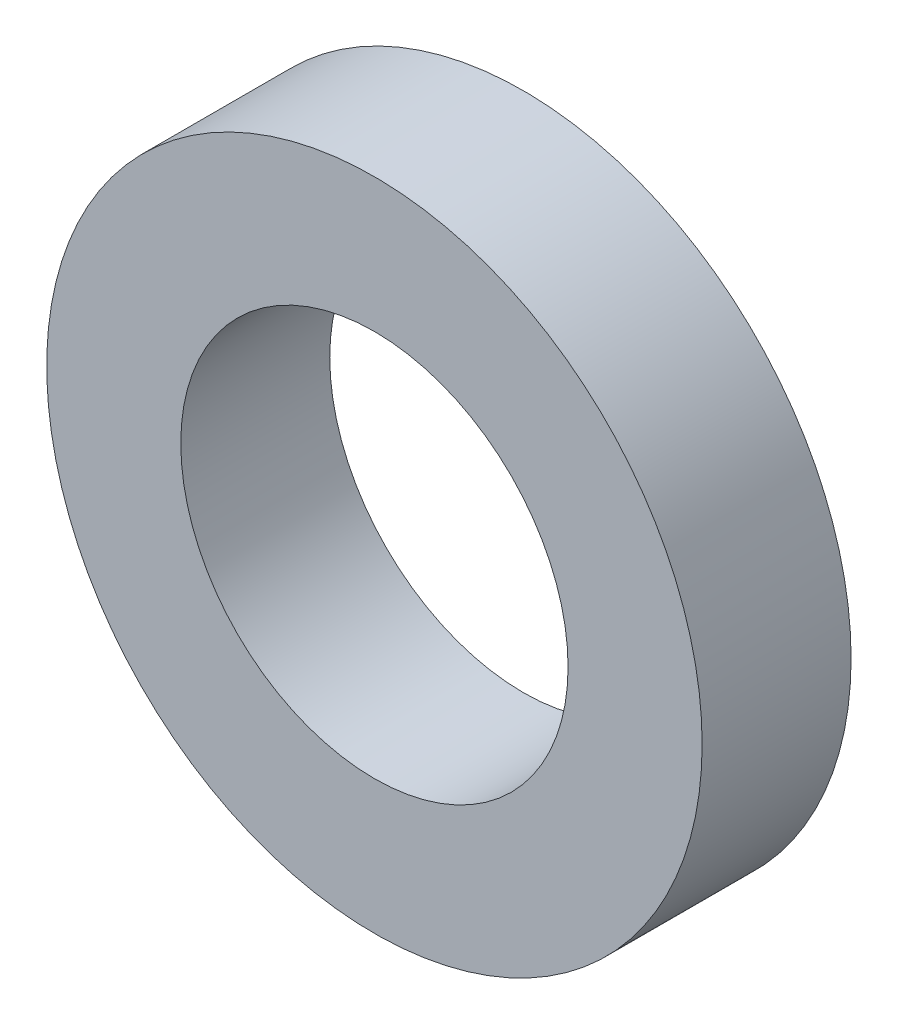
ISO-10303-21;
HEADER;
FILE_DESCRIPTION(('STEP AP214'),'2;1');
FILE_NAME('part.step','',(''),(''),'','','');
FILE_SCHEMA(('AUTOMOTIVE_DESIGN { 1 0 10303 214 1 1 1 1 }'));
ENDSEC;
DATA;
#1=APPLICATION_CONTEXT('core data for automotive mechanical design processes');
#2=APPLICATION_PROTOCOL_DEFINITION('international standard','automotive_design',2000,#1);
#3=PRODUCT_CONTEXT('',#1,'mechanical');
#4=PRODUCT('Part','Part','',(#3));
#5=PRODUCT_RELATED_PRODUCT_CATEGORY('part','',(#4));
#6=PRODUCT_DEFINITION_FORMATION('','',#4);
#7=PRODUCT_DEFINITION_CONTEXT('part definition',#1,'design');
#8=PRODUCT_DEFINITION('design','',#6,#7);
#9=PRODUCT_DEFINITION_SHAPE('','',#8);
#10=(LENGTH_UNIT() NAMED_UNIT(*) SI_UNIT(.MILLI.,.METRE.));
#11=(NAMED_UNIT(*) PLANE_ANGLE_UNIT() SI_UNIT($,.RADIAN.));
#12=(NAMED_UNIT(*) SI_UNIT($,.STERADIAN.) SOLID_ANGLE_UNIT());
#13=UNCERTAINTY_MEASURE_WITH_UNIT(LENGTH_MEASURE(1.E-05),#10,'distance_accuracy_value','');
#14=(GEOMETRIC_REPRESENTATION_CONTEXT(3) GLOBAL_UNCERTAINTY_ASSIGNED_CONTEXT((#13)) GLOBAL_UNIT_ASSIGNED_CONTEXT((#10,
#11,#12)) REPRESENTATION_CONTEXT('',''));
#15=CARTESIAN_POINT('',(0.,0.,0.));
#16=DIRECTION('',(0.,0.,1.));
#17=DIRECTION('',(1.,0.,0.));
#18=AXIS2_PLACEMENT_3D('',#15,#16,#17);
#19=CARTESIAN_POINT('',(0.,0.,5.));
#20=DIRECTION('',(0.,0.,1.));
#21=DIRECTION('',(1.,0.,0.));
#22=AXIS2_PLACEMENT_3D('',#19,#20,#21);
#23=PLANE('',#22);
#24=CARTESIAN_POINT('',(0.,0.,5.));
#25=DIRECTION('',(0.,0.,1.));
#26=DIRECTION('',(1.,0.,0.));
#27=AXIS2_PLACEMENT_3D('',#24,#25,#26);
#28=CIRCLE('',#27,11.);
#29=CARTESIAN_POINT('',(11.,0.,5.));
#30=VERTEX_POINT('',#29);
#31=EDGE_CURVE('E10',#30,#30,#28,.T.);
#32=ORIENTED_EDGE('',*,*,#31,.T.);
#33=EDGE_LOOP('',(#32));
#34=FACE_BOUND('',#33,.T.);
#35=CARTESIAN_POINT('',(0.,0.,5.));
#36=DIRECTION('',(0.,0.,1.));
#37=DIRECTION('',(1.,0.,0.));
#38=AXIS2_PLACEMENT_3D('',#35,#36,#37);
#39=CIRCLE('',#38,6.5);
#40=CARTESIAN_POINT('',(6.5,0.,5.));
#41=VERTEX_POINT('',#40);
#42=EDGE_CURVE('E41',#41,#41,#39,.T.);
#43=ORIENTED_EDGE('',*,*,#42,.F.);
#44=EDGE_LOOP('',(#43));
#45=FACE_BOUND('',#44,.T.);
#46=ADVANCED_FACE('F30',(#34,#45),#23,.T.);
#47=CARTESIAN_POINT('',(0.,0.,0.));
#48=DIRECTION('',(0.,0.,1.));
#49=DIRECTION('',(1.,0.,0.));
#50=AXIS2_PLACEMENT_3D('',#47,#48,#49);
#51=PLANE('',#50);
#52=CARTESIAN_POINT('',(0.,0.,0.));
#53=DIRECTION('',(0.,0.,1.));
#54=DIRECTION('',(1.,0.,0.));
#55=AXIS2_PLACEMENT_3D('',#52,#53,#54);
#56=CIRCLE('',#55,11.);
#57=CARTESIAN_POINT('',(11.,0.,0.));
#58=VERTEX_POINT('',#57);
#59=EDGE_CURVE('E34',#58,#58,#56,.T.);
#60=ORIENTED_EDGE('',*,*,#59,.F.);
#61=EDGE_LOOP('',(#60));
#62=FACE_BOUND('',#61,.T.);
#63=CARTESIAN_POINT('',(0.,0.,0.));
#64=DIRECTION('',(0.,0.,1.));
#65=DIRECTION('',(1.,0.,0.));
#66=AXIS2_PLACEMENT_3D('',#63,#64,#65);
#67=CIRCLE('',#66,6.5);
#68=CARTESIAN_POINT('',(6.5,0.,0.));
#69=VERTEX_POINT('',#68);
#70=EDGE_CURVE('E43',#69,#69,#67,.T.);
#71=ORIENTED_EDGE('',*,*,#70,.T.);
#72=EDGE_LOOP('',(#71));
#73=FACE_BOUND('',#72,.T.);
#74=ADVANCED_FACE('F53',(#62,#73),#51,.F.);
#75=CARTESIAN_POINT('',(0.,0.,5.));
#76=DIRECTION('',(0.,0.,-1.));
#77=DIRECTION('',(-1.,0.,0.));
#78=AXIS2_PLACEMENT_3D('',#75,#76,#77);
#79=CYLINDRICAL_SURFACE('',#78,11.);
#80=ORIENTED_EDGE('',*,*,#31,.F.);
#81=EDGE_LOOP('',(#80));
#82=FACE_BOUND('',#81,.T.);
#83=ORIENTED_EDGE('',*,*,#59,.T.);
#84=EDGE_LOOP('',(#83));
#85=FACE_BOUND('',#84,.T.);
#86=ADVANCED_FACE('F32',(#82,#85),#79,.T.);
#87=CARTESIAN_POINT('',(0.,0.,5.));
#88=DIRECTION('',(0.,0.,-1.));
#89=DIRECTION('',(-1.,0.,0.));
#90=AXIS2_PLACEMENT_3D('',#87,#88,#89);
#91=CYLINDRICAL_SURFACE('',#90,6.5);
#92=ORIENTED_EDGE('',*,*,#42,.T.);
#93=EDGE_LOOP('',(#92));
#94=FACE_BOUND('',#93,.T.);
#95=ORIENTED_EDGE('',*,*,#70,.F.);
#96=EDGE_LOOP('',(#95));
#97=FACE_BOUND('',#96,.T.);
#98=ADVANCED_FACE('F49',(#94,#97),#91,.F.);
#99=CLOSED_SHELL('',(#46,#74,#86,#98));
#100=MANIFOLD_SOLID_BREP('B2',#99);
#101=ADVANCED_BREP_SHAPE_REPRESENTATION('',(#18,#100),#14);
#102=SHAPE_DEFINITION_REPRESENTATION(#9,#101);
ENDSEC;
END-ISO-10303-21;
